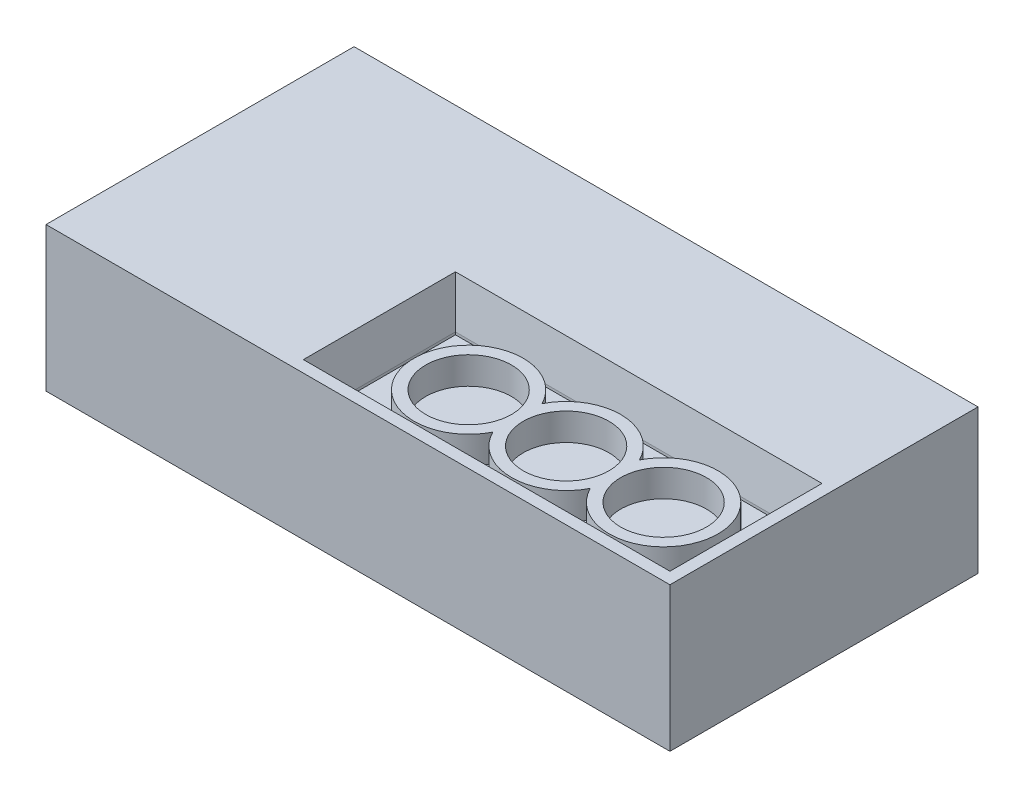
ISO-10303-21;
HEADER;
FILE_DESCRIPTION(('STEP AP214'),'2;1');
FILE_NAME('part.step','',(''),(''),'','','');
FILE_SCHEMA(('AUTOMOTIVE_DESIGN { 1 0 10303 214 1 1 1 1 }'));
ENDSEC;
DATA;
#1=APPLICATION_CONTEXT('core data for automotive mechanical design processes');
#2=APPLICATION_PROTOCOL_DEFINITION('international standard','automotive_design',2000,#1);
#3=PRODUCT_CONTEXT('',#1,'mechanical');
#4=PRODUCT('Part','Part','',(#3));
#5=PRODUCT_RELATED_PRODUCT_CATEGORY('part','',(#4));
#6=PRODUCT_DEFINITION_FORMATION('','',#4);
#7=PRODUCT_DEFINITION_CONTEXT('part definition',#1,'design');
#8=PRODUCT_DEFINITION('design','',#6,#7);
#9=PRODUCT_DEFINITION_SHAPE('','',#8);
#10=(LENGTH_UNIT() NAMED_UNIT(*) SI_UNIT(.MILLI.,.METRE.));
#11=(NAMED_UNIT(*) PLANE_ANGLE_UNIT() SI_UNIT($,.RADIAN.));
#12=(NAMED_UNIT(*) SI_UNIT($,.STERADIAN.) SOLID_ANGLE_UNIT());
#13=UNCERTAINTY_MEASURE_WITH_UNIT(LENGTH_MEASURE(1.E-05),#10,'distance_accuracy_value','');
#14=(GEOMETRIC_REPRESENTATION_CONTEXT(3) GLOBAL_UNCERTAINTY_ASSIGNED_CONTEXT((#13)) GLOBAL_UNIT_ASSIGNED_CONTEXT((#10,
#11,#12)) REPRESENTATION_CONTEXT('',''));
#15=CARTESIAN_POINT('',(0.,0.,0.));
#16=DIRECTION('',(0.,0.,1.));
#17=DIRECTION('',(1.,0.,0.));
#18=AXIS2_PLACEMENT_3D('',#15,#16,#17);
#19=CARTESIAN_POINT('',(80.,37.,39.5));
#20=DIRECTION('',(-1.,0.,0.));
#21=DIRECTION('',(0.,0.,1.));
#22=AXIS2_PLACEMENT_3D('',#19,#20,#21);
#23=PLANE('',#22);
#24=DIRECTION('',(0.,0.,-1.));
#25=VECTOR('',#24,1.);
#26=CARTESIAN_POINT('',(80.,0.,39.5));
#27=LINE('',#26,#25);
#28=CARTESIAN_POINT('',(80.,0.,39.5));
#29=VERTEX_POINT('',#28);
#30=CARTESIAN_POINT('',(80.,0.,-39.5));
#31=VERTEX_POINT('',#30);
#32=EDGE_CURVE('E184',#29,#31,#27,.T.);
#33=ORIENTED_EDGE('',*,*,#32,.T.);
#34=DIRECTION('',(0.,-1.,0.));
#35=VECTOR('',#34,1.);
#36=CARTESIAN_POINT('',(80.,37.,-39.5));
#37=LINE('',#36,#35);
#38=CARTESIAN_POINT('',(80.,37.,-39.5));
#39=VERTEX_POINT('',#38);
#40=EDGE_CURVE('E217',#39,#31,#37,.T.);
#41=ORIENTED_EDGE('',*,*,#40,.F.);
#42=DIRECTION('',(0.,0.,-1.));
#43=VECTOR('',#42,1.);
#44=CARTESIAN_POINT('',(80.,37.,39.5));
#45=LINE('',#44,#43);
#46=CARTESIAN_POINT('',(80.,37.,39.5));
#47=VERTEX_POINT('',#46);
#48=EDGE_CURVE('E191',#47,#39,#45,.T.);
#49=ORIENTED_EDGE('',*,*,#48,.F.);
#50=DIRECTION('',(0.,-1.,0.));
#51=VECTOR('',#50,1.);
#52=CARTESIAN_POINT('',(80.,37.,39.5));
#53=LINE('',#52,#51);
#54=EDGE_CURVE('E201',#47,#29,#53,.T.);
#55=ORIENTED_EDGE('',*,*,#54,.T.);
#56=EDGE_LOOP('',(#33,#41,#49,#55));
#57=FACE_BOUND('',#56,.T.);
#58=ADVANCED_FACE('F36',(#57),#23,.F.);
#59=CARTESIAN_POINT('',(-80.,37.,-39.5));
#60=DIRECTION('',(0.,0.,1.));
#61=DIRECTION('',(1.,0.,0.));
#62=AXIS2_PLACEMENT_3D('',#59,#60,#61);
#63=PLANE('',#62);
#64=DIRECTION('',(-1.,0.,0.));
#65=VECTOR('',#64,1.);
#66=CARTESIAN_POINT('',(-80.,0.,-39.5));
#67=LINE('',#66,#65);
#68=CARTESIAN_POINT('',(-80.,0.,-39.5));
#69=VERTEX_POINT('',#68);
#70=EDGE_CURVE('E204',#31,#69,#67,.T.);
#71=ORIENTED_EDGE('',*,*,#70,.T.);
#72=DIRECTION('',(0.,-1.,0.));
#73=VECTOR('',#72,1.);
#74=CARTESIAN_POINT('',(-80.,37.,-39.5));
#75=LINE('',#74,#73);
#76=CARTESIAN_POINT('',(-80.,37.,-39.5));
#77=VERTEX_POINT('',#76);
#78=EDGE_CURVE('E214',#77,#69,#75,.T.);
#79=ORIENTED_EDGE('',*,*,#78,.F.);
#80=DIRECTION('',(-1.,0.,0.));
#81=VECTOR('',#80,1.);
#82=CARTESIAN_POINT('',(-80.,37.,-39.5));
#83=LINE('',#82,#81);
#84=EDGE_CURVE('E194',#39,#77,#83,.T.);
#85=ORIENTED_EDGE('',*,*,#84,.F.);
#86=ORIENTED_EDGE('',*,*,#40,.T.);
#87=EDGE_LOOP('',(#71,#79,#85,#86));
#88=FACE_BOUND('',#87,.T.);
#89=ADVANCED_FACE('F313',(#88),#63,.F.);
#90=CARTESIAN_POINT('',(-80.,37.,39.5));
#91=DIRECTION('',(1.,0.,0.));
#92=DIRECTION('',(0.,0.,-1.));
#93=AXIS2_PLACEMENT_3D('',#90,#91,#92);
#94=PLANE('',#93);
#95=DIRECTION('',(0.,0.,1.));
#96=VECTOR('',#95,1.);
#97=CARTESIAN_POINT('',(-80.,0.,39.5));
#98=LINE('',#97,#96);
#99=CARTESIAN_POINT('',(-80.,0.,39.5));
#100=VERTEX_POINT('',#99);
#101=EDGE_CURVE('E206',#69,#100,#98,.T.);
#102=ORIENTED_EDGE('',*,*,#101,.T.);
#103=DIRECTION('',(0.,-1.,0.));
#104=VECTOR('',#103,1.);
#105=CARTESIAN_POINT('',(-80.,37.,39.5));
#106=LINE('',#105,#104);
#107=CARTESIAN_POINT('',(-80.,37.,39.5));
#108=VERTEX_POINT('',#107);
#109=EDGE_CURVE('E211',#108,#100,#106,.T.);
#110=ORIENTED_EDGE('',*,*,#109,.F.);
#111=DIRECTION('',(0.,0.,1.));
#112=VECTOR('',#111,1.);
#113=CARTESIAN_POINT('',(-80.,37.,39.5));
#114=LINE('',#113,#112);
#115=EDGE_CURVE('E197',#77,#108,#114,.T.);
#116=ORIENTED_EDGE('',*,*,#115,.F.);
#117=ORIENTED_EDGE('',*,*,#78,.T.);
#118=EDGE_LOOP('',(#102,#110,#116,#117));
#119=FACE_BOUND('',#118,.T.);
#120=ADVANCED_FACE('F319',(#119),#94,.F.);
#121=CARTESIAN_POINT('',(-80.,37.,39.5));
#122=DIRECTION('',(0.,0.,-1.));
#123=DIRECTION('',(-1.,0.,0.));
#124=AXIS2_PLACEMENT_3D('',#121,#122,#123);
#125=PLANE('',#124);
#126=DIRECTION('',(1.,0.,0.));
#127=VECTOR('',#126,1.);
#128=CARTESIAN_POINT('',(-80.,0.,39.5));
#129=LINE('',#128,#127);
#130=EDGE_CURVE('E195',#100,#29,#129,.T.);
#131=ORIENTED_EDGE('',*,*,#130,.T.);
#132=ORIENTED_EDGE('',*,*,#54,.F.);
#133=DIRECTION('',(1.,0.,0.));
#134=VECTOR('',#133,1.);
#135=CARTESIAN_POINT('',(-80.,37.,39.5));
#136=LINE('',#135,#134);
#137=EDGE_CURVE('E199',#108,#47,#136,.T.);
#138=ORIENTED_EDGE('',*,*,#137,.F.);
#139=ORIENTED_EDGE('',*,*,#109,.T.);
#140=EDGE_LOOP('',(#131,#132,#138,#139));
#141=FACE_BOUND('',#140,.T.);
#142=ADVANCED_FACE('F349',(#141),#125,.F.);
#143=CARTESIAN_POINT('',(0.,37.,0.));
#144=DIRECTION('',(0.,-1.,0.));
#145=DIRECTION('',(0.,0.,-1.));
#146=AXIS2_PLACEMENT_3D('',#143,#144,#145);
#147=PLANE('',#146);
#148=DIRECTION('',(-1.,0.,0.));
#149=VECTOR('',#148,1.);
#150=CARTESIAN_POINT('',(0.,37.,36.5));
#151=LINE('',#150,#149);
#152=CARTESIAN_POINT('',(77.,37.,36.5));
#153=VERTEX_POINT('',#152);
#154=CARTESIAN_POINT('',(-17.,37.,36.5));
#155=VERTEX_POINT('',#154);
#156=EDGE_CURVE('E236',#153,#155,#151,.T.);
#157=ORIENTED_EDGE('',*,*,#156,.T.);
#158=DIRECTION('',(0.,0.,-1.));
#159=VECTOR('',#158,1.);
#160=CARTESIAN_POINT('',(-17.,37.,0.));
#161=LINE('',#160,#159);
#162=CARTESIAN_POINT('',(-17.,37.,-2.49999999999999));
#163=VERTEX_POINT('',#162);
#164=EDGE_CURVE('E238',#155,#163,#161,.T.);
#165=ORIENTED_EDGE('',*,*,#164,.T.);
#166=DIRECTION('',(1.,0.,0.));
#167=VECTOR('',#166,1.);
#168=CARTESIAN_POINT('',(0.,37.,-2.49999999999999));
#169=LINE('',#168,#167);
#170=CARTESIAN_POINT('',(77.,37.,-2.5));
#171=VERTEX_POINT('',#170);
#172=EDGE_CURVE('E232',#163,#171,#169,.T.);
#173=ORIENTED_EDGE('',*,*,#172,.T.);
#174=DIRECTION('',(0.,0.,1.));
#175=VECTOR('',#174,1.);
#176=CARTESIAN_POINT('',(77.,37.,0.));
#177=LINE('',#176,#175);
#178=EDGE_CURVE('E234',#171,#153,#177,.T.);
#179=ORIENTED_EDGE('',*,*,#178,.T.);
#180=EDGE_LOOP('',(#157,#165,#173,#179));
#181=FACE_BOUND('',#180,.T.);
#182=ORIENTED_EDGE('',*,*,#48,.T.);
#183=ORIENTED_EDGE('',*,*,#84,.T.);
#184=ORIENTED_EDGE('',*,*,#115,.T.);
#185=ORIENTED_EDGE('',*,*,#137,.T.);
#186=EDGE_LOOP('',(#182,#183,#184,#185));
#187=FACE_BOUND('',#186,.T.);
#188=ADVANCED_FACE('F345',(#181,#187),#147,.F.);
#189=CARTESIAN_POINT('',(0.,0.,0.));
#190=DIRECTION('',(0.,-1.,0.));
#191=DIRECTION('',(0.,0.,-1.));
#192=AXIS2_PLACEMENT_3D('',#189,#190,#191);
#193=PLANE('',#192);
#194=ORIENTED_EDGE('',*,*,#32,.F.);
#195=ORIENTED_EDGE('',*,*,#130,.F.);
#196=ORIENTED_EDGE('',*,*,#101,.F.);
#197=ORIENTED_EDGE('',*,*,#70,.F.);
#198=EDGE_LOOP('',(#194,#195,#196,#197));
#199=FACE_BOUND('',#198,.T.);
#200=ADVANCED_FACE('F310',(#199),#193,.T.);
#201=CARTESIAN_POINT('',(75.,25.,34.5));
#202=DIRECTION('',(1.,0.,0.));
#203=DIRECTION('',(0.,0.,-1.));
#204=AXIS2_PLACEMENT_3D('',#201,#202,#203);
#205=PLANE('',#204);
#206=DIRECTION('',(0.,1.,0.));
#207=VECTOR('',#206,1.);
#208=CARTESIAN_POINT('',(75.,25.,34.5));
#209=LINE('',#208,#207);
#210=CARTESIAN_POINT('',(75.,25.,34.5));
#211=VERTEX_POINT('',#210);
#212=CARTESIAN_POINT('',(75.,25.6574363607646,34.5));
#213=VERTEX_POINT('',#212);
#214=EDGE_CURVE('E182',#211,#213,#209,.T.);
#215=ORIENTED_EDGE('',*,*,#214,.T.);
#216=DIRECTION('',(0.,0.,-1.));
#217=VECTOR('',#216,1.);
#218=CARTESIAN_POINT('',(75.,25.6574363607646,34.5));
#219=LINE('',#218,#217);
#220=CARTESIAN_POINT('',(75.,25.6574363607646,-0.5));
#221=VERTEX_POINT('',#220);
#222=EDGE_CURVE('E45',#213,#221,#219,.T.);
#223=ORIENTED_EDGE('',*,*,#222,.T.);
#224=DIRECTION('',(0.,1.,0.));
#225=VECTOR('',#224,1.);
#226=CARTESIAN_POINT('',(75.,25.,-0.5));
#227=LINE('',#226,#225);
#228=CARTESIAN_POINT('',(75.,25.,-0.5));
#229=VERTEX_POINT('',#228);
#230=EDGE_CURVE('E181',#229,#221,#227,.T.);
#231=ORIENTED_EDGE('',*,*,#230,.F.);
#232=DIRECTION('',(0.,0.,-1.));
#233=VECTOR('',#232,1.);
#234=CARTESIAN_POINT('',(75.,25.,34.5));
#235=LINE('',#234,#233);
#236=EDGE_CURVE('E164',#211,#229,#235,.T.);
#237=ORIENTED_EDGE('',*,*,#236,.F.);
#238=EDGE_LOOP('',(#215,#223,#231,#237));
#239=FACE_BOUND('',#238,.T.);
#240=ADVANCED_FACE('F296',(#239),#205,.F.);
#241=CARTESIAN_POINT('',(75.,25.,34.5));
#242=DIRECTION('',(0.,0.,1.));
#243=DIRECTION('',(1.,0.,0.));
#244=AXIS2_PLACEMENT_3D('',#241,#242,#243);
#245=PLANE('',#244);
#246=DIRECTION('',(0.,1.,0.));
#247=VECTOR('',#246,1.);
#248=CARTESIAN_POINT('',(-15.,25.,34.5));
#249=LINE('',#248,#247);
#250=CARTESIAN_POINT('',(-15.,25.,34.5));
#251=VERTEX_POINT('',#250);
#252=CARTESIAN_POINT('',(-15.,25.6574363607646,34.5));
#253=VERTEX_POINT('',#252);
#254=EDGE_CURVE('E185',#251,#253,#249,.T.);
#255=ORIENTED_EDGE('',*,*,#254,.T.);
#256=DIRECTION('',(1.,0.,0.));
#257=VECTOR('',#256,1.);
#258=CARTESIAN_POINT('',(75.,25.6574363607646,34.5));
#259=LINE('',#258,#257);
#260=EDGE_CURVE('E60',#253,#213,#259,.T.);
#261=ORIENTED_EDGE('',*,*,#260,.T.);
#262=ORIENTED_EDGE('',*,*,#214,.F.);
#263=DIRECTION('',(1.,0.,0.));
#264=VECTOR('',#263,1.);
#265=CARTESIAN_POINT('',(75.,25.,34.5));
#266=LINE('',#265,#264);
#267=EDGE_CURVE('E178',#251,#211,#266,.T.);
#268=ORIENTED_EDGE('',*,*,#267,.F.);
#269=EDGE_LOOP('',(#255,#261,#262,#268));
#270=FACE_BOUND('',#269,.T.);
#271=ADVANCED_FACE('F302',(#270),#245,.F.);
#272=CARTESIAN_POINT('',(-15.,25.,34.5));
#273=DIRECTION('',(-1.,0.,0.));
#274=DIRECTION('',(0.,0.,1.));
#275=AXIS2_PLACEMENT_3D('',#272,#273,#274);
#276=PLANE('',#275);
#277=DIRECTION('',(0.,1.,0.));
#278=VECTOR('',#277,1.);
#279=CARTESIAN_POINT('',(-15.,25.,-0.49999999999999));
#280=LINE('',#279,#278);
#281=CARTESIAN_POINT('',(-15.,25.,-0.49999999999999));
#282=VERTEX_POINT('',#281);
#283=CARTESIAN_POINT('',(-15.,25.6574363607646,-0.49999999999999));
#284=VERTEX_POINT('',#283);
#285=EDGE_CURVE('E187',#282,#284,#280,.T.);
#286=ORIENTED_EDGE('',*,*,#285,.T.);
#287=DIRECTION('',(0.,0.,1.));
#288=VECTOR('',#287,1.);
#289=CARTESIAN_POINT('',(-15.,25.6574363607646,34.5));
#290=LINE('',#289,#288);
#291=EDGE_CURVE('E229',#284,#253,#290,.T.);
#292=ORIENTED_EDGE('',*,*,#291,.T.);
#293=ORIENTED_EDGE('',*,*,#254,.F.);
#294=DIRECTION('',(0.,0.,1.));
#295=VECTOR('',#294,1.);
#296=CARTESIAN_POINT('',(-15.,25.,34.5));
#297=LINE('',#296,#295);
#298=EDGE_CURVE('E175',#282,#251,#297,.T.);
#299=ORIENTED_EDGE('',*,*,#298,.F.);
#300=EDGE_LOOP('',(#286,#292,#293,#299));
#301=FACE_BOUND('',#300,.T.);
#302=ADVANCED_FACE('F301',(#301),#276,.F.);
#303=CARTESIAN_POINT('',(75.,25.,-0.5));
#304=DIRECTION('',(0.,0.,-1.));
#305=DIRECTION('',(-1.,0.,0.));
#306=AXIS2_PLACEMENT_3D('',#303,#304,#305);
#307=PLANE('',#306);
#308=ORIENTED_EDGE('',*,*,#230,.T.);
#309=DIRECTION('',(-1.,0.,0.));
#310=VECTOR('',#309,1.);
#311=CARTESIAN_POINT('',(75.,25.6574363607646,-0.5));
#312=LINE('',#311,#310);
#313=EDGE_CURVE('E11',#221,#284,#312,.T.);
#314=ORIENTED_EDGE('',*,*,#313,.T.);
#315=ORIENTED_EDGE('',*,*,#285,.F.);
#316=DIRECTION('',(-1.,0.,0.));
#317=VECTOR('',#316,1.);
#318=CARTESIAN_POINT('',(75.,25.,-0.5));
#319=LINE('',#318,#317);
#320=EDGE_CURVE('E167',#229,#282,#319,.T.);
#321=ORIENTED_EDGE('',*,*,#320,.F.);
#322=EDGE_LOOP('',(#308,#314,#315,#321));
#323=FACE_BOUND('',#322,.T.);
#324=ADVANCED_FACE('F289',(#323),#307,.F.);
#325=CARTESIAN_POINT('',(0.,25.,0.));
#326=DIRECTION('',(0.,1.,0.));
#327=DIRECTION('',(0.,0.,1.));
#328=AXIS2_PLACEMENT_3D('',#325,#326,#327);
#329=PLANE('',#328);
#330=CARTESIAN_POINT('',(55.88123848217,25.,17.));
#331=DIRECTION('',(0.,1.,0.));
#332=DIRECTION('',(0.,0.,1.));
#333=AXIS2_PLACEMENT_3D('',#330,#331,#332);
#334=CIRCLE('',#333,14.);
#335=CARTESIAN_POINT('',(43.38123848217,25.,23.3047601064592));
#336=VERTEX_POINT('',#335);
#337=CARTESIAN_POINT('',(43.38123848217,25.,10.6952398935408));
#338=VERTEX_POINT('',#337);
#339=EDGE_CURVE('E272',#336,#338,#334,.T.);
#340=ORIENTED_EDGE('',*,*,#339,.F.);
#341=CARTESIAN_POINT('',(30.88123848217,25.,17.));
#342=DIRECTION('',(0.,1.,0.));
#343=DIRECTION('',(0.,0.,1.));
#344=AXIS2_PLACEMENT_3D('',#341,#342,#343);
#345=CIRCLE('',#344,14.);
#346=CARTESIAN_POINT('',(18.38123848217,25.,23.3047601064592));
#347=VERTEX_POINT('',#346);
#348=EDGE_CURVE('E162',#347,#336,#345,.T.);
#349=ORIENTED_EDGE('',*,*,#348,.F.);
#350=CARTESIAN_POINT('',(5.88123848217,25.,17.));
#351=DIRECTION('',(0.,1.,0.));
#352=DIRECTION('',(0.,0.,1.));
#353=AXIS2_PLACEMENT_3D('',#350,#351,#352);
#354=CIRCLE('',#353,14.);
#355=CARTESIAN_POINT('',(18.38123848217,25.,10.6952398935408));
#356=VERTEX_POINT('',#355);
#357=EDGE_CURVE('E158',#356,#347,#354,.T.);
#358=ORIENTED_EDGE('',*,*,#357,.F.);
#359=CARTESIAN_POINT('',(30.88123848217,25.,17.));
#360=DIRECTION('',(0.,1.,0.));
#361=DIRECTION('',(0.,0.,1.));
#362=AXIS2_PLACEMENT_3D('',#359,#360,#361);
#363=CIRCLE('',#362,14.);
#364=EDGE_CURVE('E274',#338,#356,#363,.T.);
#365=ORIENTED_EDGE('',*,*,#364,.F.);
#366=EDGE_LOOP('',(#340,#349,#358,#365));
#367=FACE_BOUND('',#366,.T.);
#368=ORIENTED_EDGE('',*,*,#236,.T.);
#369=ORIENTED_EDGE('',*,*,#320,.T.);
#370=ORIENTED_EDGE('',*,*,#298,.T.);
#371=ORIENTED_EDGE('',*,*,#267,.T.);
#372=EDGE_LOOP('',(#368,#369,#370,#371));
#373=FACE_BOUND('',#372,.T.);
#374=ADVANCED_FACE('F286',(#367,#373),#329,.T.);
#375=CARTESIAN_POINT('',(43.38123848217,32.,17.));
#376=DIRECTION('',(0.,1.,0.));
#377=DIRECTION('',(0.,0.,1.));
#378=AXIS2_PLACEMENT_3D('',#375,#376,#377);
#379=PLANE('',#378);
#380=CARTESIAN_POINT('',(30.88123848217,32.,17.));
#381=DIRECTION('',(0.,1.,0.));
#382=DIRECTION('',(0.,0.,1.));
#383=AXIS2_PLACEMENT_3D('',#380,#381,#382);
#384=CIRCLE('',#383,11.);
#385=CARTESIAN_POINT('',(30.88123848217,32.,28.));
#386=VERTEX_POINT('',#385);
#387=EDGE_CURVE('E258',#386,#386,#384,.T.);
#388=ORIENTED_EDGE('',*,*,#387,.F.);
#389=EDGE_LOOP('',(#388));
#390=FACE_BOUND('',#389,.T.);
#391=CARTESIAN_POINT('',(30.88123848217,32.,17.));
#392=DIRECTION('',(0.,1.,0.));
#393=DIRECTION('',(0.,0.,1.));
#394=AXIS2_PLACEMENT_3D('',#391,#392,#393);
#395=CIRCLE('',#394,14.);
#396=CARTESIAN_POINT('',(18.38123848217,32.,23.3047601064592));
#397=VERTEX_POINT('',#396);
#398=CARTESIAN_POINT('',(43.38123848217,32.,23.3047601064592));
#399=VERTEX_POINT('',#398);
#400=EDGE_CURVE('E148',#397,#399,#395,.T.);
#401=ORIENTED_EDGE('',*,*,#400,.T.);
#402=CARTESIAN_POINT('',(55.88123848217,32.,17.));
#403=DIRECTION('',(0.,1.,0.));
#404=DIRECTION('',(0.,0.,1.));
#405=AXIS2_PLACEMENT_3D('',#402,#403,#404);
#406=CIRCLE('',#405,14.);
#407=CARTESIAN_POINT('',(43.38123848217,32.,10.6952398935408));
#408=VERTEX_POINT('',#407);
#409=EDGE_CURVE('E137',#399,#408,#406,.T.);
#410=ORIENTED_EDGE('',*,*,#409,.T.);
#411=CARTESIAN_POINT('',(30.88123848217,32.,17.));
#412=DIRECTION('',(0.,1.,0.));
#413=DIRECTION('',(0.,0.,1.));
#414=AXIS2_PLACEMENT_3D('',#411,#412,#413);
#415=CIRCLE('',#414,14.);
#416=CARTESIAN_POINT('',(18.38123848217,32.,10.6952398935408));
#417=VERTEX_POINT('',#416);
#418=EDGE_CURVE('E147',#408,#417,#415,.T.);
#419=ORIENTED_EDGE('',*,*,#418,.T.);
#420=CARTESIAN_POINT('',(5.88123848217,32.,17.));
#421=DIRECTION('',(0.,1.,0.));
#422=DIRECTION('',(0.,0.,1.));
#423=AXIS2_PLACEMENT_3D('',#420,#421,#422);
#424=CIRCLE('',#423,14.);
#425=EDGE_CURVE('E154',#417,#397,#424,.T.);
#426=ORIENTED_EDGE('',*,*,#425,.T.);
#427=EDGE_LOOP('',(#401,#410,#419,#426));
#428=FACE_BOUND('',#427,.T.);
#429=CARTESIAN_POINT('',(55.88123848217,32.,17.));
#430=DIRECTION('',(0.,1.,0.));
#431=DIRECTION('',(0.,0.,1.));
#432=AXIS2_PLACEMENT_3D('',#429,#430,#431);
#433=CIRCLE('',#432,11.);
#434=CARTESIAN_POINT('',(55.88123848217,32.,28.));
#435=VERTEX_POINT('',#434);
#436=EDGE_CURVE('E263',#435,#435,#433,.T.);
#437=ORIENTED_EDGE('',*,*,#436,.F.);
#438=EDGE_LOOP('',(#437));
#439=FACE_BOUND('',#438,.T.);
#440=CARTESIAN_POINT('',(5.88123848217,32.,17.));
#441=DIRECTION('',(0.,1.,0.));
#442=DIRECTION('',(0.,0.,1.));
#443=AXIS2_PLACEMENT_3D('',#440,#441,#442);
#444=CIRCLE('',#443,11.);
#445=CARTESIAN_POINT('',(5.88123848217,32.,28.));
#446=VERTEX_POINT('',#445);
#447=EDGE_CURVE('E252',#446,#446,#444,.T.);
#448=ORIENTED_EDGE('',*,*,#447,.F.);
#449=EDGE_LOOP('',(#448));
#450=FACE_BOUND('',#449,.T.);
#451=ADVANCED_FACE('F151',(#390,#428,#439,#450),#379,.T.);
#452=CARTESIAN_POINT('',(30.88123848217,32.,17.));
#453=DIRECTION('',(0.,-1.,0.));
#454=DIRECTION('',(0.,0.,-1.));
#455=AXIS2_PLACEMENT_3D('',#452,#453,#454);
#456=CYLINDRICAL_SURFACE('',#455,14.);
#457=ORIENTED_EDGE('',*,*,#348,.T.);
#458=DIRECTION('',(0.,-1.,0.));
#459=VECTOR('',#458,1.);
#460=CARTESIAN_POINT('',(43.38123848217,32.,23.3047601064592));
#461=LINE('',#460,#459);
#462=EDGE_CURVE('E141',#399,#336,#461,.T.);
#463=ORIENTED_EDGE('',*,*,#462,.F.);
#464=ORIENTED_EDGE('',*,*,#400,.F.);
#465=DIRECTION('',(0.,-1.,0.));
#466=VECTOR('',#465,1.);
#467=CARTESIAN_POINT('',(18.38123848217,32.,23.3047601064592));
#468=LINE('',#467,#466);
#469=EDGE_CURVE('E270',#397,#347,#468,.T.);
#470=ORIENTED_EDGE('',*,*,#469,.T.);
#471=EDGE_LOOP('',(#457,#463,#464,#470));
#472=FACE_BOUND('',#471,.T.);
#473=ADVANCED_FACE('F160',(#472),#456,.T.);
#474=CARTESIAN_POINT('',(55.88123848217,32.,17.));
#475=DIRECTION('',(0.,-1.,0.));
#476=DIRECTION('',(0.,0.,-1.));
#477=AXIS2_PLACEMENT_3D('',#474,#475,#476);
#478=CYLINDRICAL_SURFACE('',#477,14.);
#479=ORIENTED_EDGE('',*,*,#339,.T.);
#480=DIRECTION('',(0.,-1.,0.));
#481=VECTOR('',#480,1.);
#482=CARTESIAN_POINT('',(43.38123848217,32.,10.6952398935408));
#483=LINE('',#482,#481);
#484=EDGE_CURVE('E144',#408,#338,#483,.T.);
#485=ORIENTED_EDGE('',*,*,#484,.F.);
#486=ORIENTED_EDGE('',*,*,#409,.F.);
#487=ORIENTED_EDGE('',*,*,#462,.T.);
#488=EDGE_LOOP('',(#479,#485,#486,#487));
#489=FACE_BOUND('',#488,.T.);
#490=ADVANCED_FACE('F139',(#489),#478,.T.);
#491=CARTESIAN_POINT('',(30.88123848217,32.,17.));
#492=DIRECTION('',(0.,-1.,0.));
#493=DIRECTION('',(0.,0.,-1.));
#494=AXIS2_PLACEMENT_3D('',#491,#492,#493);
#495=CYLINDRICAL_SURFACE('',#494,14.);
#496=ORIENTED_EDGE('',*,*,#364,.T.);
#497=DIRECTION('',(0.,-1.,0.));
#498=VECTOR('',#497,1.);
#499=CARTESIAN_POINT('',(18.38123848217,32.,10.6952398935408));
#500=LINE('',#499,#498);
#501=EDGE_CURVE('E169',#417,#356,#500,.T.);
#502=ORIENTED_EDGE('',*,*,#501,.F.);
#503=ORIENTED_EDGE('',*,*,#418,.F.);
#504=ORIENTED_EDGE('',*,*,#484,.T.);
#505=EDGE_LOOP('',(#496,#502,#503,#504));
#506=FACE_BOUND('',#505,.T.);
#507=ADVANCED_FACE('F284',(#506),#495,.T.);
#508=CARTESIAN_POINT('',(5.88123848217,32.,17.));
#509=DIRECTION('',(0.,-1.,0.));
#510=DIRECTION('',(0.,0.,-1.));
#511=AXIS2_PLACEMENT_3D('',#508,#509,#510);
#512=CYLINDRICAL_SURFACE('',#511,14.);
#513=ORIENTED_EDGE('',*,*,#357,.T.);
#514=ORIENTED_EDGE('',*,*,#469,.F.);
#515=ORIENTED_EDGE('',*,*,#425,.F.);
#516=ORIENTED_EDGE('',*,*,#501,.T.);
#517=EDGE_LOOP('',(#513,#514,#515,#516));
#518=FACE_BOUND('',#517,.T.);
#519=ADVANCED_FACE('F280',(#518),#512,.T.);
#520=CARTESIAN_POINT('',(55.88123848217,32.,17.));
#521=DIRECTION('',(0.,-1.,0.));
#522=DIRECTION('',(0.,0.,-1.));
#523=AXIS2_PLACEMENT_3D('',#520,#521,#522);
#524=CYLINDRICAL_SURFACE('',#523,11.);
#525=ORIENTED_EDGE('',*,*,#436,.T.);
#526=EDGE_LOOP('',(#525));
#527=FACE_BOUND('',#526,.T.);
#528=CARTESIAN_POINT('',(55.88123848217,25.,17.));
#529=DIRECTION('',(0.,1.,0.));
#530=DIRECTION('',(0.,0.,1.));
#531=AXIS2_PLACEMENT_3D('',#528,#529,#530);
#532=CIRCLE('',#531,11.);
#533=CARTESIAN_POINT('',(55.88123848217,25.,28.));
#534=VERTEX_POINT('',#533);
#535=EDGE_CURVE('E226',#534,#534,#532,.F.);
#536=ORIENTED_EDGE('',*,*,#535,.T.);
#537=EDGE_LOOP('',(#536));
#538=FACE_BOUND('',#537,.T.);
#539=ADVANCED_FACE('F427',(#527,#538),#524,.F.);
#540=CARTESIAN_POINT('',(30.88123848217,32.,17.));
#541=DIRECTION('',(0.,-1.,0.));
#542=DIRECTION('',(0.,0.,-1.));
#543=AXIS2_PLACEMENT_3D('',#540,#541,#542);
#544=CYLINDRICAL_SURFACE('',#543,11.);
#545=ORIENTED_EDGE('',*,*,#387,.T.);
#546=EDGE_LOOP('',(#545));
#547=FACE_BOUND('',#546,.T.);
#548=CARTESIAN_POINT('',(30.88123848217,25.,17.));
#549=DIRECTION('',(0.,1.,0.));
#550=DIRECTION('',(0.,0.,1.));
#551=AXIS2_PLACEMENT_3D('',#548,#549,#550);
#552=CIRCLE('',#551,11.);
#553=CARTESIAN_POINT('',(30.88123848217,25.,28.));
#554=VERTEX_POINT('',#553);
#555=EDGE_CURVE('E223',#554,#554,#552,.F.);
#556=ORIENTED_EDGE('',*,*,#555,.T.);
#557=EDGE_LOOP('',(#556));
#558=FACE_BOUND('',#557,.T.);
#559=ADVANCED_FACE('F434',(#547,#558),#544,.F.);
#560=CARTESIAN_POINT('',(5.88123848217,32.,17.));
#561=DIRECTION('',(0.,-1.,0.));
#562=DIRECTION('',(0.,0.,-1.));
#563=AXIS2_PLACEMENT_3D('',#560,#561,#562);
#564=CYLINDRICAL_SURFACE('',#563,11.);
#565=ORIENTED_EDGE('',*,*,#447,.T.);
#566=EDGE_LOOP('',(#565));
#567=FACE_BOUND('',#566,.T.);
#568=CARTESIAN_POINT('',(5.88123848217,25.,17.));
#569=DIRECTION('',(0.,1.,0.));
#570=DIRECTION('',(0.,0.,1.));
#571=AXIS2_PLACEMENT_3D('',#568,#569,#570);
#572=CIRCLE('',#571,11.);
#573=CARTESIAN_POINT('',(5.88123848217,25.,28.));
#574=VERTEX_POINT('',#573);
#575=EDGE_CURVE('E220',#574,#574,#572,.F.);
#576=ORIENTED_EDGE('',*,*,#575,.T.);
#577=EDGE_LOOP('',(#576));
#578=FACE_BOUND('',#577,.T.);
#579=ADVANCED_FACE('F442',(#567,#578),#564,.F.);
#580=ORIENTED_EDGE('',*,*,#575,.F.);
#581=EDGE_LOOP('',(#580));
#582=FACE_BOUND('',#581,.T.);
#583=ADVANCED_FACE('F292',(#582),#329,.T.);
#584=ORIENTED_EDGE('',*,*,#555,.F.);
#585=EDGE_LOOP('',(#584));
#586=FACE_BOUND('',#585,.T.);
#587=ADVANCED_FACE('F339',(#586),#329,.T.);
#588=ORIENTED_EDGE('',*,*,#535,.F.);
#589=EDGE_LOOP('',(#588));
#590=FACE_BOUND('',#589,.T.);
#591=ADVANCED_FACE('F291',(#590),#329,.T.);
#592=CARTESIAN_POINT('',(75.,25.6574363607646,34.5));
#593=DIRECTION('',(0.984807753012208,-0.173648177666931,0.));
#594=DIRECTION('',(0.,0.,-1.));
#595=AXIS2_PLACEMENT_3D('',#592,#593,#594);
#596=PLANE('',#595);
#597=DIRECTION('',(0.171087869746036,0.970287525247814,0.171087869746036));
#598=VECTOR('',#597,1.);
#599=CARTESIAN_POINT('',(75.,25.6574363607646,34.5));
#600=LINE('',#599,#598);
#601=EDGE_CURVE('E246',#153,#213,#600,.F.);
#602=ORIENTED_EDGE('',*,*,#601,.F.);
#603=ORIENTED_EDGE('',*,*,#178,.F.);
#604=DIRECTION('',(0.171087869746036,0.970287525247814,-0.171087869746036));
#605=VECTOR('',#604,1.);
#606=CARTESIAN_POINT('',(73.9755129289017,19.8472814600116,0.524487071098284));
#607=LINE('',#606,#605);
#608=EDGE_CURVE('E40',#221,#171,#607,.T.);
#609=ORIENTED_EDGE('',*,*,#608,.F.);
#610=ORIENTED_EDGE('',*,*,#222,.F.);
#611=EDGE_LOOP('',(#602,#603,#609,#610));
#612=FACE_BOUND('',#611,.T.);
#613=ADVANCED_FACE('F38',(#612),#596,.F.);
#614=CARTESIAN_POINT('',(75.,25.6574363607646,-0.5));
#615=DIRECTION('',(0.,-0.173648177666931,-0.984807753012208));
#616=DIRECTION('',(-1.,0.,0.));
#617=AXIS2_PLACEMENT_3D('',#614,#615,#616);
#618=PLANE('',#617);
#619=ORIENTED_EDGE('',*,*,#608,.T.);
#620=ORIENTED_EDGE('',*,*,#172,.F.);
#621=DIRECTION('',(0.171087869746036,-0.970287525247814,0.171087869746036));
#622=VECTOR('',#621,1.);
#623=CARTESIAN_POINT('',(-13.9755129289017,19.8472814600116,0.524487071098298));
#624=LINE('',#623,#622);
#625=EDGE_CURVE('E245',#284,#163,#624,.F.);
#626=ORIENTED_EDGE('',*,*,#625,.F.);
#627=ORIENTED_EDGE('',*,*,#313,.F.);
#628=EDGE_LOOP('',(#619,#620,#626,#627));
#629=FACE_BOUND('',#628,.T.);
#630=ADVANCED_FACE('F330',(#629),#618,.F.);
#631=CARTESIAN_POINT('',(75.,25.6574363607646,34.5));
#632=DIRECTION('',(0.,-0.173648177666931,0.984807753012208));
#633=DIRECTION('',(1.,0.,0.));
#634=AXIS2_PLACEMENT_3D('',#631,#632,#633);
#635=PLANE('',#634);
#636=ORIENTED_EDGE('',*,*,#601,.T.);
#637=ORIENTED_EDGE('',*,*,#260,.F.);
#638=DIRECTION('',(-0.171087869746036,0.970287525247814,0.171087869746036));
#639=VECTOR('',#638,1.);
#640=CARTESIAN_POINT('',(-15.,25.6574363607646,34.5));
#641=LINE('',#640,#639);
#642=EDGE_CURVE('E243',#155,#253,#641,.F.);
#643=ORIENTED_EDGE('',*,*,#642,.F.);
#644=ORIENTED_EDGE('',*,*,#156,.F.);
#645=EDGE_LOOP('',(#636,#637,#643,#644));
#646=FACE_BOUND('',#645,.T.);
#647=ADVANCED_FACE('F327',(#646),#635,.F.);
#648=CARTESIAN_POINT('',(-15.,25.6574363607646,34.5));
#649=DIRECTION('',(-0.984807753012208,-0.173648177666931,0.));
#650=DIRECTION('',(0.,0.,1.));
#651=AXIS2_PLACEMENT_3D('',#648,#649,#650);
#652=PLANE('',#651);
#653=ORIENTED_EDGE('',*,*,#625,.T.);
#654=ORIENTED_EDGE('',*,*,#164,.F.);
#655=ORIENTED_EDGE('',*,*,#642,.T.);
#656=ORIENTED_EDGE('',*,*,#291,.F.);
#657=EDGE_LOOP('',(#653,#654,#655,#656));
#658=FACE_BOUND('',#657,.T.);
#659=ADVANCED_FACE('F324',(#658),#652,.F.);
#660=CLOSED_SHELL('',(#58,#89,#120,#142,#188,#200,#240,#271,#302,#324,#374,#451,#473,#490,#507,
#519,#539,#559,#579,#583,#587,#591,#613,#630,#647,#659));
#661=MANIFOLD_SOLID_BREP('B2',#660);
#662=ADVANCED_BREP_SHAPE_REPRESENTATION('',(#18,#661),#14);
#663=SHAPE_DEFINITION_REPRESENTATION(#9,#662);
ENDSEC;
END-ISO-10303-21;
